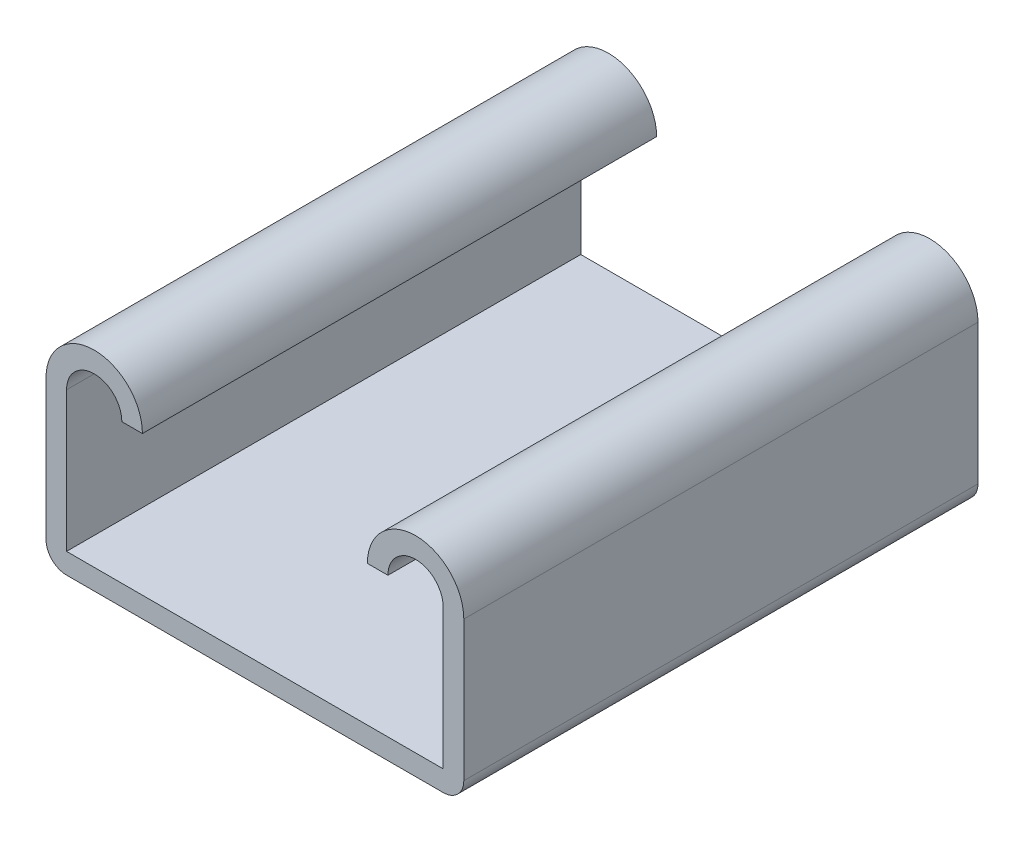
ISO-10303-21;
HEADER;
FILE_DESCRIPTION(('STEP AP214'),'2;1');
FILE_NAME('part.step','',(''),(''),'','','');
FILE_SCHEMA(('AUTOMOTIVE_DESIGN { 1 0 10303 214 1 1 1 1 }'));
ENDSEC;
DATA;
#1=APPLICATION_CONTEXT('core data for automotive mechanical design processes');
#2=APPLICATION_PROTOCOL_DEFINITION('international standard','automotive_design',2000,#1);
#3=PRODUCT_CONTEXT('',#1,'mechanical');
#4=PRODUCT('Part','Part','',(#3));
#5=PRODUCT_RELATED_PRODUCT_CATEGORY('part','',(#4));
#6=PRODUCT_DEFINITION_FORMATION('','',#4);
#7=PRODUCT_DEFINITION_CONTEXT('part definition',#1,'design');
#8=PRODUCT_DEFINITION('design','',#6,#7);
#9=PRODUCT_DEFINITION_SHAPE('','',#8);
#10=(LENGTH_UNIT() NAMED_UNIT(*) SI_UNIT(.MILLI.,.METRE.));
#11=(NAMED_UNIT(*) PLANE_ANGLE_UNIT() SI_UNIT($,.RADIAN.));
#12=(NAMED_UNIT(*) SI_UNIT($,.STERADIAN.) SOLID_ANGLE_UNIT());
#13=UNCERTAINTY_MEASURE_WITH_UNIT(LENGTH_MEASURE(1.E-05),#10,'distance_accuracy_value','');
#14=(GEOMETRIC_REPRESENTATION_CONTEXT(3) GLOBAL_UNCERTAINTY_ASSIGNED_CONTEXT((#13)) GLOBAL_UNIT_ASSIGNED_CONTEXT((#10,
#11,#12)) REPRESENTATION_CONTEXT('',''));
#15=CARTESIAN_POINT('',(0.,0.,0.));
#16=DIRECTION('',(0.,0.,1.));
#17=DIRECTION('',(1.,0.,0.));
#18=AXIS2_PLACEMENT_3D('',#15,#16,#17);
#19=CARTESIAN_POINT('',(-7.9375,3.79095,12.7));
#20=DIRECTION('',(0.,0.,-1.));
#21=DIRECTION('',(-1.,0.,0.));
#22=AXIS2_PLACEMENT_3D('',#19,#20,#21);
#23=CYLINDRICAL_SURFACE('',#22,2.38125);
#24=CARTESIAN_POINT('',(-7.9375,3.79095,-12.7));
#25=DIRECTION('',(0.,0.,1.));
#26=DIRECTION('',(-1.,0.,0.));
#27=AXIS2_PLACEMENT_3D('',#24,#25,#26);
#28=CIRCLE('',#27,2.38125);
#29=CARTESIAN_POINT('',(-5.55625,3.79095,-12.7));
#30=VERTEX_POINT('',#29);
#31=CARTESIAN_POINT('',(-10.31875,3.79095,-12.7));
#32=VERTEX_POINT('',#31);
#33=EDGE_CURVE('E165',#30,#32,#28,.T.);
#34=ORIENTED_EDGE('',*,*,#33,.T.);
#35=DIRECTION('',(0.,0.,-1.));
#36=VECTOR('',#35,1.);
#37=CARTESIAN_POINT('',(-10.31875,3.79095,12.7));
#38=LINE('',#37,#36);
#39=CARTESIAN_POINT('',(-10.31875,3.79095,12.7));
#40=VERTEX_POINT('',#39);
#41=EDGE_CURVE('E11',#40,#32,#38,.T.);
#42=ORIENTED_EDGE('',*,*,#41,.F.);
#43=CARTESIAN_POINT('',(-7.9375,3.79095,12.7));
#44=DIRECTION('',(0.,0.,1.));
#45=DIRECTION('',(-1.,0.,0.));
#46=AXIS2_PLACEMENT_3D('',#43,#44,#45);
#47=CIRCLE('',#46,2.38125);
#48=CARTESIAN_POINT('',(-5.55625,3.79095,12.7));
#49=VERTEX_POINT('',#48);
#50=EDGE_CURVE('E191',#49,#40,#47,.T.);
#51=ORIENTED_EDGE('',*,*,#50,.F.);
#52=DIRECTION('',(0.,0.,-1.));
#53=VECTOR('',#52,1.);
#54=CARTESIAN_POINT('',(-5.55625,3.79095,12.7));
#55=LINE('',#54,#53);
#56=EDGE_CURVE('E161',#49,#30,#55,.T.);
#57=ORIENTED_EDGE('',*,*,#56,.T.);
#58=EDGE_LOOP('',(#34,#42,#51,#57));
#59=FACE_BOUND('',#58,.T.);
#60=ADVANCED_FACE('F33',(#59),#23,.T.);
#61=CARTESIAN_POINT('',(-10.31875,3.79095,12.7));
#62=DIRECTION('',(1.,0.,0.));
#63=DIRECTION('',(0.,1.,0.));
#64=AXIS2_PLACEMENT_3D('',#61,#62,#63);
#65=PLANE('',#64);
#66=DIRECTION('',(0.,-1.,0.));
#67=VECTOR('',#66,1.);
#68=CARTESIAN_POINT('',(-10.31875,3.79095,-12.7));
#69=LINE('',#68,#67);
#70=CARTESIAN_POINT('',(-10.31875,-3.1242,-12.7));
#71=VERTEX_POINT('',#70);
#72=EDGE_CURVE('E168',#32,#71,#69,.T.);
#73=ORIENTED_EDGE('',*,*,#72,.T.);
#74=DIRECTION('',(0.,0.,-1.));
#75=VECTOR('',#74,1.);
#76=CARTESIAN_POINT('',(-10.31875,-3.1242,12.7));
#77=LINE('',#76,#75);
#78=CARTESIAN_POINT('',(-10.31875,-3.1242,12.7));
#79=VERTEX_POINT('',#78);
#80=EDGE_CURVE('E41',#79,#71,#77,.T.);
#81=ORIENTED_EDGE('',*,*,#80,.F.);
#82=DIRECTION('',(0.,-1.,0.));
#83=VECTOR('',#82,1.);
#84=CARTESIAN_POINT('',(-10.31875,3.79095,12.7));
#85=LINE('',#84,#83);
#86=EDGE_CURVE('E110',#40,#79,#85,.T.);
#87=ORIENTED_EDGE('',*,*,#86,.F.);
#88=ORIENTED_EDGE('',*,*,#41,.T.);
#89=EDGE_LOOP('',(#73,#81,#87,#88));
#90=FACE_BOUND('',#89,.T.);
#91=ADVANCED_FACE('F279',(#90),#65,.F.);
#92=CARTESIAN_POINT('',(-9.30275,-3.1242,12.7));
#93=DIRECTION('',(0.,0.,-1.));
#94=DIRECTION('',(-1.,0.,0.));
#95=AXIS2_PLACEMENT_3D('',#92,#93,#94);
#96=CYLINDRICAL_SURFACE('',#95,1.016);
#97=CARTESIAN_POINT('',(-9.30275,-3.1242,-12.7));
#98=DIRECTION('',(0.,0.,1.));
#99=DIRECTION('',(-1.,0.,0.));
#100=AXIS2_PLACEMENT_3D('',#97,#98,#99);
#101=CIRCLE('',#100,1.016);
#102=CARTESIAN_POINT('',(-9.30275,-4.1402,-12.7));
#103=VERTEX_POINT('',#102);
#104=EDGE_CURVE('E170',#71,#103,#101,.T.);
#105=ORIENTED_EDGE('',*,*,#104,.T.);
#106=DIRECTION('',(0.,0.,-1.));
#107=VECTOR('',#106,1.);
#108=CARTESIAN_POINT('',(-9.30275,-4.1402,12.7));
#109=LINE('',#108,#107);
#110=CARTESIAN_POINT('',(-9.30275,-4.1402,12.7));
#111=VERTEX_POINT('',#110);
#112=EDGE_CURVE('E216',#111,#103,#109,.T.);
#113=ORIENTED_EDGE('',*,*,#112,.F.);
#114=CARTESIAN_POINT('',(-9.30275,-3.1242,12.7));
#115=DIRECTION('',(0.,0.,1.));
#116=DIRECTION('',(-1.,0.,0.));
#117=AXIS2_PLACEMENT_3D('',#114,#115,#116);
#118=CIRCLE('',#117,1.016);
#119=EDGE_CURVE('E224',#79,#111,#118,.T.);
#120=ORIENTED_EDGE('',*,*,#119,.F.);
#121=ORIENTED_EDGE('',*,*,#80,.T.);
#122=EDGE_LOOP('',(#105,#113,#120,#121));
#123=FACE_BOUND('',#122,.T.);
#124=ADVANCED_FACE('F222',(#123),#96,.T.);
#125=CARTESIAN_POINT('',(-9.30275,-4.1402,12.7));
#126=DIRECTION('',(0.,1.,0.));
#127=DIRECTION('',(-1.,0.,0.));
#128=AXIS2_PLACEMENT_3D('',#125,#126,#127);
#129=PLANE('',#128);
#130=DIRECTION('',(1.,0.,0.));
#131=VECTOR('',#130,1.);
#132=CARTESIAN_POINT('',(-9.30275,-4.1402,-12.7));
#133=LINE('',#132,#131);
#134=CARTESIAN_POINT('',(9.30275,-4.1402,-12.7));
#135=VERTEX_POINT('',#134);
#136=EDGE_CURVE('E172',#103,#135,#133,.T.);
#137=ORIENTED_EDGE('',*,*,#136,.T.);
#138=DIRECTION('',(0.,0.,-1.));
#139=VECTOR('',#138,1.);
#140=CARTESIAN_POINT('',(9.30275,-4.1402,12.7));
#141=LINE('',#140,#139);
#142=CARTESIAN_POINT('',(9.30275,-4.1402,12.7));
#143=VERTEX_POINT('',#142);
#144=EDGE_CURVE('E213',#143,#135,#141,.T.);
#145=ORIENTED_EDGE('',*,*,#144,.F.);
#146=DIRECTION('',(1.,0.,0.));
#147=VECTOR('',#146,1.);
#148=CARTESIAN_POINT('',(-9.30275,-4.1402,12.7));
#149=LINE('',#148,#147);
#150=EDGE_CURVE('E242',#111,#143,#149,.T.);
#151=ORIENTED_EDGE('',*,*,#150,.F.);
#152=ORIENTED_EDGE('',*,*,#112,.T.);
#153=EDGE_LOOP('',(#137,#145,#151,#152));
#154=FACE_BOUND('',#153,.T.);
#155=ADVANCED_FACE('F233',(#154),#129,.F.);
#156=CARTESIAN_POINT('',(9.30275,-3.1242,12.7));
#157=DIRECTION('',(0.,0.,-1.));
#158=DIRECTION('',(-1.,0.,0.));
#159=AXIS2_PLACEMENT_3D('',#156,#157,#158);
#160=CYLINDRICAL_SURFACE('',#159,1.016);
#161=CARTESIAN_POINT('',(9.30275,-3.1242,-12.7));
#162=DIRECTION('',(0.,0.,1.));
#163=DIRECTION('',(1.,0.,0.));
#164=AXIS2_PLACEMENT_3D('',#161,#162,#163);
#165=CIRCLE('',#164,1.016);
#166=CARTESIAN_POINT('',(10.31875,-3.1242,-12.7));
#167=VERTEX_POINT('',#166);
#168=EDGE_CURVE('E174',#135,#167,#165,.T.);
#169=ORIENTED_EDGE('',*,*,#168,.T.);
#170=DIRECTION('',(0.,0.,-1.));
#171=VECTOR('',#170,1.);
#172=CARTESIAN_POINT('',(10.31875,-3.1242,12.7));
#173=LINE('',#172,#171);
#174=CARTESIAN_POINT('',(10.31875,-3.1242,12.7));
#175=VERTEX_POINT('',#174);
#176=EDGE_CURVE('E210',#175,#167,#173,.T.);
#177=ORIENTED_EDGE('',*,*,#176,.F.);
#178=CARTESIAN_POINT('',(9.30275,-3.1242,12.7));
#179=DIRECTION('',(0.,0.,1.));
#180=DIRECTION('',(1.,0.,0.));
#181=AXIS2_PLACEMENT_3D('',#178,#179,#180);
#182=CIRCLE('',#181,1.016);
#183=EDGE_CURVE('E239',#143,#175,#182,.T.);
#184=ORIENTED_EDGE('',*,*,#183,.F.);
#185=ORIENTED_EDGE('',*,*,#144,.T.);
#186=EDGE_LOOP('',(#169,#177,#184,#185));
#187=FACE_BOUND('',#186,.T.);
#188=ADVANCED_FACE('F237',(#187),#160,.T.);
#189=CARTESIAN_POINT('',(10.31875,-3.1242,12.7));
#190=DIRECTION('',(-1.,0.,0.));
#191=DIRECTION('',(0.,0.,1.));
#192=AXIS2_PLACEMENT_3D('',#189,#190,#191);
#193=PLANE('',#192);
#194=DIRECTION('',(0.,1.,0.));
#195=VECTOR('',#194,1.);
#196=CARTESIAN_POINT('',(10.31875,-3.1242,-12.7));
#197=LINE('',#196,#195);
#198=CARTESIAN_POINT('',(10.31875,3.79095,-12.7));
#199=VERTEX_POINT('',#198);
#200=EDGE_CURVE('E176',#167,#199,#197,.T.);
#201=ORIENTED_EDGE('',*,*,#200,.T.);
#202=DIRECTION('',(0.,0.,-1.));
#203=VECTOR('',#202,1.);
#204=CARTESIAN_POINT('',(10.31875,3.79095,12.7));
#205=LINE('',#204,#203);
#206=CARTESIAN_POINT('',(10.31875,3.79095,12.7));
#207=VERTEX_POINT('',#206);
#208=EDGE_CURVE('E207',#207,#199,#205,.T.);
#209=ORIENTED_EDGE('',*,*,#208,.F.);
#210=DIRECTION('',(0.,1.,0.));
#211=VECTOR('',#210,1.);
#212=CARTESIAN_POINT('',(10.31875,-3.1242,12.7));
#213=LINE('',#212,#211);
#214=EDGE_CURVE('E241',#175,#207,#213,.T.);
#215=ORIENTED_EDGE('',*,*,#214,.F.);
#216=ORIENTED_EDGE('',*,*,#176,.T.);
#217=EDGE_LOOP('',(#201,#209,#215,#216));
#218=FACE_BOUND('',#217,.T.);
#219=ADVANCED_FACE('F292',(#218),#193,.F.);
#220=CARTESIAN_POINT('',(7.9375,3.79095,12.7));
#221=DIRECTION('',(0.,0.,-1.));
#222=DIRECTION('',(-1.,0.,0.));
#223=AXIS2_PLACEMENT_3D('',#220,#221,#222);
#224=CYLINDRICAL_SURFACE('',#223,2.38125);
#225=CARTESIAN_POINT('',(7.9375,3.79095,-12.7));
#226=DIRECTION('',(0.,0.,1.));
#227=DIRECTION('',(1.,0.,0.));
#228=AXIS2_PLACEMENT_3D('',#225,#226,#227);
#229=CIRCLE('',#228,2.38125);
#230=CARTESIAN_POINT('',(5.55625,3.79095,-12.7));
#231=VERTEX_POINT('',#230);
#232=EDGE_CURVE('E178',#199,#231,#229,.T.);
#233=ORIENTED_EDGE('',*,*,#232,.T.);
#234=DIRECTION('',(0.,0.,-1.));
#235=VECTOR('',#234,1.);
#236=CARTESIAN_POINT('',(5.55625,3.79095,12.7));
#237=LINE('',#236,#235);
#238=CARTESIAN_POINT('',(5.55625,3.79095,12.7));
#239=VERTEX_POINT('',#238);
#240=EDGE_CURVE('E204',#239,#231,#237,.T.);
#241=ORIENTED_EDGE('',*,*,#240,.F.);
#242=CARTESIAN_POINT('',(7.9375,3.79095,12.7));
#243=DIRECTION('',(0.,0.,1.));
#244=DIRECTION('',(1.,0.,0.));
#245=AXIS2_PLACEMENT_3D('',#242,#243,#244);
#246=CIRCLE('',#245,2.38125);
#247=EDGE_CURVE('E244',#207,#239,#246,.T.);
#248=ORIENTED_EDGE('',*,*,#247,.F.);
#249=ORIENTED_EDGE('',*,*,#208,.T.);
#250=EDGE_LOOP('',(#233,#241,#248,#249));
#251=FACE_BOUND('',#250,.T.);
#252=ADVANCED_FACE('F295',(#251),#224,.T.);
#253=CARTESIAN_POINT('',(5.55625,3.79095,12.7));
#254=DIRECTION('',(0.,1.,0.));
#255=DIRECTION('',(-1.,0.,0.));
#256=AXIS2_PLACEMENT_3D('',#253,#254,#255);
#257=PLANE('',#256);
#258=DIRECTION('',(1.,0.,0.));
#259=VECTOR('',#258,1.);
#260=CARTESIAN_POINT('',(5.55625,3.79095,-12.7));
#261=LINE('',#260,#259);
#262=CARTESIAN_POINT('',(6.57225,3.79095,-12.7));
#263=VERTEX_POINT('',#262);
#264=EDGE_CURVE('E180',#231,#263,#261,.T.);
#265=ORIENTED_EDGE('',*,*,#264,.T.);
#266=DIRECTION('',(0.,0.,-1.));
#267=VECTOR('',#266,1.);
#268=CARTESIAN_POINT('',(6.57225,3.79095,12.7));
#269=LINE('',#268,#267);
#270=CARTESIAN_POINT('',(6.57225,3.79095,12.7));
#271=VERTEX_POINT('',#270);
#272=EDGE_CURVE('E201',#271,#263,#269,.T.);
#273=ORIENTED_EDGE('',*,*,#272,.F.);
#274=DIRECTION('',(1.,0.,0.));
#275=VECTOR('',#274,1.);
#276=CARTESIAN_POINT('',(5.55625,3.79095,12.7));
#277=LINE('',#276,#275);
#278=EDGE_CURVE('E250',#239,#271,#277,.T.);
#279=ORIENTED_EDGE('',*,*,#278,.F.);
#280=ORIENTED_EDGE('',*,*,#240,.T.);
#281=EDGE_LOOP('',(#265,#273,#279,#280));
#282=FACE_BOUND('',#281,.T.);
#283=ADVANCED_FACE('F299',(#282),#257,.F.);
#284=CARTESIAN_POINT('',(7.9375,3.79095,12.7));
#285=DIRECTION('',(0.,0.,-1.));
#286=DIRECTION('',(-1.,0.,0.));
#287=AXIS2_PLACEMENT_3D('',#284,#285,#286);
#288=CYLINDRICAL_SURFACE('',#287,1.36525);
#289=CARTESIAN_POINT('',(7.9375,3.79095,-12.7));
#290=DIRECTION('',(0.,0.,-1.));
#291=DIRECTION('',(1.,0.,0.));
#292=AXIS2_PLACEMENT_3D('',#289,#290,#291);
#293=CIRCLE('',#292,1.36525);
#294=CARTESIAN_POINT('',(9.30275,3.79095,-12.7));
#295=VERTEX_POINT('',#294);
#296=EDGE_CURVE('E182',#263,#295,#293,.T.);
#297=ORIENTED_EDGE('',*,*,#296,.T.);
#298=DIRECTION('',(0.,0.,-1.));
#299=VECTOR('',#298,1.);
#300=CARTESIAN_POINT('',(9.30275,3.79095,12.7));
#301=LINE('',#300,#299);
#302=CARTESIAN_POINT('',(9.30275,3.79095,12.7));
#303=VERTEX_POINT('',#302);
#304=EDGE_CURVE('E198',#303,#295,#301,.T.);
#305=ORIENTED_EDGE('',*,*,#304,.F.);
#306=CARTESIAN_POINT('',(7.9375,3.79095,12.7));
#307=DIRECTION('',(0.,0.,-1.));
#308=DIRECTION('',(1.,0.,0.));
#309=AXIS2_PLACEMENT_3D('',#306,#307,#308);
#310=CIRCLE('',#309,1.36525);
#311=EDGE_CURVE('E252',#271,#303,#310,.T.);
#312=ORIENTED_EDGE('',*,*,#311,.F.);
#313=ORIENTED_EDGE('',*,*,#272,.T.);
#314=EDGE_LOOP('',(#297,#305,#312,#313));
#315=FACE_BOUND('',#314,.T.);
#316=ADVANCED_FACE('F303',(#315),#288,.F.);
#317=CARTESIAN_POINT('',(9.30275,-3.1242,12.7));
#318=DIRECTION('',(1.,0.,0.));
#319=DIRECTION('',(0.,1.,0.));
#320=AXIS2_PLACEMENT_3D('',#317,#318,#319);
#321=PLANE('',#320);
#322=DIRECTION('',(0.,-1.,0.));
#323=VECTOR('',#322,1.);
#324=CARTESIAN_POINT('',(9.30275,-3.1242,-12.7));
#325=LINE('',#324,#323);
#326=CARTESIAN_POINT('',(9.30275,-3.1242,-12.7));
#327=VERTEX_POINT('',#326);
#328=EDGE_CURVE('E184',#295,#327,#325,.T.);
#329=ORIENTED_EDGE('',*,*,#328,.T.);
#330=DIRECTION('',(0.,0.,-1.));
#331=VECTOR('',#330,1.);
#332=CARTESIAN_POINT('',(9.30275,-3.1242,12.7));
#333=LINE('',#332,#331);
#334=CARTESIAN_POINT('',(9.30275,-3.1242,12.7));
#335=VERTEX_POINT('',#334);
#336=EDGE_CURVE('E195',#335,#327,#333,.T.);
#337=ORIENTED_EDGE('',*,*,#336,.F.);
#338=DIRECTION('',(0.,-1.,0.));
#339=VECTOR('',#338,1.);
#340=CARTESIAN_POINT('',(9.30275,-3.1242,12.7));
#341=LINE('',#340,#339);
#342=EDGE_CURVE('E254',#303,#335,#341,.T.);
#343=ORIENTED_EDGE('',*,*,#342,.F.);
#344=ORIENTED_EDGE('',*,*,#304,.T.);
#345=EDGE_LOOP('',(#329,#337,#343,#344));
#346=FACE_BOUND('',#345,.T.);
#347=ADVANCED_FACE('F260',(#346),#321,.F.);
#348=CARTESIAN_POINT('',(-9.30275,-3.1242,12.7));
#349=DIRECTION('',(0.,-1.,0.));
#350=DIRECTION('',(0.,0.,-1.));
#351=AXIS2_PLACEMENT_3D('',#348,#349,#350);
#352=PLANE('',#351);
#353=DIRECTION('',(-1.,0.,0.));
#354=VECTOR('',#353,1.);
#355=CARTESIAN_POINT('',(-9.30275,-3.1242,-12.7));
#356=LINE('',#355,#354);
#357=CARTESIAN_POINT('',(-9.30275,-3.1242,-12.7));
#358=VERTEX_POINT('',#357);
#359=EDGE_CURVE('E186',#327,#358,#356,.T.);
#360=ORIENTED_EDGE('',*,*,#359,.T.);
#361=DIRECTION('',(0.,0.,-1.));
#362=VECTOR('',#361,1.);
#363=CARTESIAN_POINT('',(-9.30275,-3.1242,12.7));
#364=LINE('',#363,#362);
#365=CARTESIAN_POINT('',(-9.30275,-3.1242,12.7));
#366=VERTEX_POINT('',#365);
#367=EDGE_CURVE('E156',#366,#358,#364,.T.);
#368=ORIENTED_EDGE('',*,*,#367,.F.);
#369=DIRECTION('',(-1.,0.,0.));
#370=VECTOR('',#369,1.);
#371=CARTESIAN_POINT('',(-9.30275,-3.1242,12.7));
#372=LINE('',#371,#370);
#373=EDGE_CURVE('E147',#335,#366,#372,.T.);
#374=ORIENTED_EDGE('',*,*,#373,.F.);
#375=ORIENTED_EDGE('',*,*,#336,.T.);
#376=EDGE_LOOP('',(#360,#368,#374,#375));
#377=FACE_BOUND('',#376,.T.);
#378=ADVANCED_FACE('F264',(#377),#352,.F.);
#379=CARTESIAN_POINT('',(-9.30275,3.79095,12.7));
#380=DIRECTION('',(-1.,0.,0.));
#381=DIRECTION('',(0.,-1.,0.));
#382=AXIS2_PLACEMENT_3D('',#379,#380,#381);
#383=PLANE('',#382);
#384=DIRECTION('',(0.,1.,0.));
#385=VECTOR('',#384,1.);
#386=CARTESIAN_POINT('',(-9.30275,3.79095,-12.7));
#387=LINE('',#386,#385);
#388=CARTESIAN_POINT('',(-9.30275,3.79095,-12.7));
#389=VERTEX_POINT('',#388);
#390=EDGE_CURVE('E155',#358,#389,#387,.T.);
#391=ORIENTED_EDGE('',*,*,#390,.T.);
#392=DIRECTION('',(0.,0.,-1.));
#393=VECTOR('',#392,1.);
#394=CARTESIAN_POINT('',(-9.30275,3.79095,12.7));
#395=LINE('',#394,#393);
#396=CARTESIAN_POINT('',(-9.30275,3.79095,12.7));
#397=VERTEX_POINT('',#396);
#398=EDGE_CURVE('E152',#397,#389,#395,.T.);
#399=ORIENTED_EDGE('',*,*,#398,.F.);
#400=DIRECTION('',(0.,1.,0.));
#401=VECTOR('',#400,1.);
#402=CARTESIAN_POINT('',(-9.30275,3.79095,12.7));
#403=LINE('',#402,#401);
#404=EDGE_CURVE('E141',#366,#397,#403,.T.);
#405=ORIENTED_EDGE('',*,*,#404,.F.);
#406=ORIENTED_EDGE('',*,*,#367,.T.);
#407=EDGE_LOOP('',(#391,#399,#405,#406));
#408=FACE_BOUND('',#407,.T.);
#409=ADVANCED_FACE('F153',(#408),#383,.F.);
#410=CARTESIAN_POINT('',(-7.9375,3.79095,12.7));
#411=DIRECTION('',(0.,0.,-1.));
#412=DIRECTION('',(-1.,0.,0.));
#413=AXIS2_PLACEMENT_3D('',#410,#411,#412);
#414=CYLINDRICAL_SURFACE('',#413,1.36525);
#415=CARTESIAN_POINT('',(-7.9375,3.79095,-12.7));
#416=DIRECTION('',(0.,0.,-1.));
#417=DIRECTION('',(-1.,0.,0.));
#418=AXIS2_PLACEMENT_3D('',#415,#416,#417);
#419=CIRCLE('',#418,1.36525);
#420=CARTESIAN_POINT('',(-6.57225,3.79095,-12.7));
#421=VERTEX_POINT('',#420);
#422=EDGE_CURVE('E96',#389,#421,#419,.T.);
#423=ORIENTED_EDGE('',*,*,#422,.T.);
#424=DIRECTION('',(0.,0.,-1.));
#425=VECTOR('',#424,1.);
#426=CARTESIAN_POINT('',(-6.57225,3.79095,12.7));
#427=LINE('',#426,#425);
#428=CARTESIAN_POINT('',(-6.57225,3.79095,12.7));
#429=VERTEX_POINT('',#428);
#430=EDGE_CURVE('E157',#429,#421,#427,.T.);
#431=ORIENTED_EDGE('',*,*,#430,.F.);
#432=CARTESIAN_POINT('',(-7.9375,3.79095,12.7));
#433=DIRECTION('',(0.,0.,-1.));
#434=DIRECTION('',(-1.,0.,0.));
#435=AXIS2_PLACEMENT_3D('',#432,#433,#434);
#436=CIRCLE('',#435,1.36525);
#437=EDGE_CURVE('E145',#397,#429,#436,.T.);
#438=ORIENTED_EDGE('',*,*,#437,.F.);
#439=ORIENTED_EDGE('',*,*,#398,.T.);
#440=EDGE_LOOP('',(#423,#431,#438,#439));
#441=FACE_BOUND('',#440,.T.);
#442=ADVANCED_FACE('F159',(#441),#414,.F.);
#443=CARTESIAN_POINT('',(-6.57225,3.79095,12.7));
#444=DIRECTION('',(0.,1.,0.));
#445=DIRECTION('',(0.,0.,1.));
#446=AXIS2_PLACEMENT_3D('',#443,#444,#445);
#447=PLANE('',#446);
#448=DIRECTION('',(1.,0.,0.));
#449=VECTOR('',#448,1.);
#450=CARTESIAN_POINT('',(-6.57225,3.79095,-12.7));
#451=LINE('',#450,#449);
#452=EDGE_CURVE('E102',#421,#30,#451,.T.);
#453=ORIENTED_EDGE('',*,*,#452,.T.);
#454=ORIENTED_EDGE('',*,*,#56,.F.);
#455=DIRECTION('',(1.,0.,0.));
#456=VECTOR('',#455,1.);
#457=CARTESIAN_POINT('',(-6.57225,3.79095,12.7));
#458=LINE('',#457,#456);
#459=EDGE_CURVE('E49',#429,#49,#458,.T.);
#460=ORIENTED_EDGE('',*,*,#459,.F.);
#461=ORIENTED_EDGE('',*,*,#430,.T.);
#462=EDGE_LOOP('',(#453,#454,#460,#461));
#463=FACE_BOUND('',#462,.T.);
#464=ADVANCED_FACE('F268',(#463),#447,.F.);
#465=CARTESIAN_POINT('',(-7.9375,3.79095,12.7));
#466=DIRECTION('',(0.,0.,-1.));
#467=DIRECTION('',(-1.,0.,0.));
#468=AXIS2_PLACEMENT_3D('',#465,#466,#467);
#469=PLANE('',#468);
#470=ORIENTED_EDGE('',*,*,#50,.T.);
#471=ORIENTED_EDGE('',*,*,#86,.T.);
#472=ORIENTED_EDGE('',*,*,#119,.T.);
#473=ORIENTED_EDGE('',*,*,#150,.T.);
#474=ORIENTED_EDGE('',*,*,#183,.T.);
#475=ORIENTED_EDGE('',*,*,#214,.T.);
#476=ORIENTED_EDGE('',*,*,#247,.T.);
#477=ORIENTED_EDGE('',*,*,#278,.T.);
#478=ORIENTED_EDGE('',*,*,#311,.T.);
#479=ORIENTED_EDGE('',*,*,#342,.T.);
#480=ORIENTED_EDGE('',*,*,#373,.T.);
#481=ORIENTED_EDGE('',*,*,#404,.T.);
#482=ORIENTED_EDGE('',*,*,#437,.T.);
#483=ORIENTED_EDGE('',*,*,#459,.T.);
#484=EDGE_LOOP('',(#470,#471,#472,#473,#474,#475,#476,#477,#478,#479,#480,#481,#482,#483));
#485=FACE_BOUND('',#484,.T.);
#486=ADVANCED_FACE('F143',(#485),#469,.F.);
#487=CARTESIAN_POINT('',(-7.9375,3.79095,-12.7));
#488=DIRECTION('',(0.,0.,-1.));
#489=DIRECTION('',(-1.,0.,0.));
#490=AXIS2_PLACEMENT_3D('',#487,#488,#489);
#491=PLANE('',#490);
#492=ORIENTED_EDGE('',*,*,#33,.F.);
#493=ORIENTED_EDGE('',*,*,#452,.F.);
#494=ORIENTED_EDGE('',*,*,#422,.F.);
#495=ORIENTED_EDGE('',*,*,#390,.F.);
#496=ORIENTED_EDGE('',*,*,#359,.F.);
#497=ORIENTED_EDGE('',*,*,#328,.F.);
#498=ORIENTED_EDGE('',*,*,#296,.F.);
#499=ORIENTED_EDGE('',*,*,#264,.F.);
#500=ORIENTED_EDGE('',*,*,#232,.F.);
#501=ORIENTED_EDGE('',*,*,#200,.F.);
#502=ORIENTED_EDGE('',*,*,#168,.F.);
#503=ORIENTED_EDGE('',*,*,#136,.F.);
#504=ORIENTED_EDGE('',*,*,#104,.F.);
#505=ORIENTED_EDGE('',*,*,#72,.F.);
#506=EDGE_LOOP('',(#492,#493,#494,#495,#496,#497,#498,#499,#500,#501,#502,#503,#504,#505));
#507=FACE_BOUND('',#506,.T.);
#508=ADVANCED_FACE('F228',(#507),#491,.T.);
#509=CLOSED_SHELL('',(#60,#91,#124,#155,#188,#219,#252,#283,#316,#347,#378,#409,#442,#464,#486,#508));
#510=MANIFOLD_SOLID_BREP('B2',#509);
#511=ADVANCED_BREP_SHAPE_REPRESENTATION('',(#18,#510),#14);
#512=SHAPE_DEFINITION_REPRESENTATION(#9,#511);
ENDSEC;
END-ISO-10303-21;
